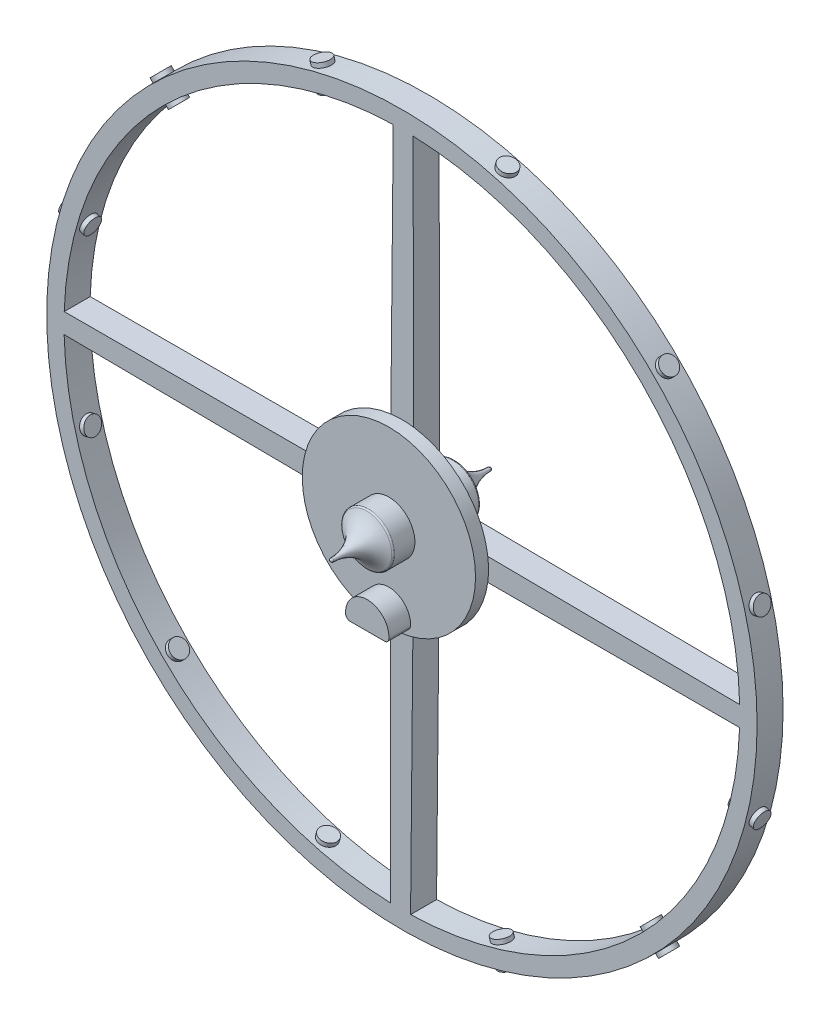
from build123d import *

# Parameters (mm, degrees)
SKETCH1_R            = 41
SKETCH1_R_2          = 3
BOSS_EXTRUDE2_DEPTH  = 3
SWEEP1_PROFILE_R     = 1
CIRPATTERN1_COUNT    = 12
SKETCH63_R           = 10
SKETCH63_R_2         = 3
BOSS_EXTRUDE3_DEPTH  = 1.5
BOSS_EXTRUDE4_DEPTH  = 4
BOSS_EXTRUDE5_START  = 2
SKETCH64_R           = 3
BOSS_EXTRUDE5_DEPTH  = 5
FILLET2_R            = 0.2
FILLET2_OF_MIRROR1_R = 0.2


with BuildPart() as part:
    # Sketch1 → Boss-Extrude2 (new body)
    with BuildSketch(Plane.XY):
        Circle(SKETCH1_R)
        Circle(SKETCH1_R_2, mode=Mode.SUBTRACT)
        with BuildLine():
            Line((38.987177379, 1), (3.771236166, 1.333333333))
            ThreePointArc((3.771236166, 1.333333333), (2.828427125, 2.828427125), (1.333333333, 3.771236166))
            Line((1.333333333, 3.771236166), (1.30155401, 38.978275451))
            ThreePointArc((1.30155401, 38.978275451), (27.683620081, 27.470296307), (38.987177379, 1))
        make_face(mode=Mode.SUBTRACT)
        with BuildLine():
            Line((-1, 38.987177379), (-1.333333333, 3.771236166))
            ThreePointArc((-1.333333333, 3.771236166), (-2.828427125, 2.828427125), (-3.771236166, 1.333333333))
            Line((-3.771236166, 1.333333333), (-38.978275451, 1.30155401))
            ThreePointArc((-38.978275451, 1.30155401), (-27.470296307, 27.683620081), (-1, 38.987177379))
        make_face(mode=Mode.SUBTRACT)
        with BuildLine():
            Line((38.978275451, -1.30155401), (3.771236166, -1.333333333))
            ThreePointArc((3.771236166, -1.333333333), (2.828427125, -2.828427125), (1.333333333, -3.771236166))
            Line((1.333333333, -3.771236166), (1, -38.987177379))
            ThreePointArc((1, -38.987177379), (27.470296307, -27.683620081), (38.978275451, -1.30155401))
        make_face(mode=Mode.SUBTRACT)
        with BuildLine():
            Line((-1.30155401, -38.978275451), (-1.333333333, -3.771236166))
            ThreePointArc((-1.333333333, -3.771236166), (-2.828427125, -2.828427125), (-3.771236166, -1.333333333))
            Line((-3.771236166, -1.333333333), (-38.987177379, -1))
            ThreePointArc((-38.987177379, -1), (-27.683620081, -27.470296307), (-1.30155401, -38.978275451))
        make_face(mode=Mode.SUBTRACT)
    extrude(amount=BOSS_EXTRUDE2_DEPTH)

    # Sweep1: sweep along a path in Sketch2
    with BuildLine(Plane.XY.offset(1.5)) as sweep1_path:
        Line((9.964533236, 37.188144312), (10.740990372, 40.085921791))
    # Sweep1 profile (on start of the path) → Sweep1 (sweep)
    with BuildSketch(Plane(origin=(9.964533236, 37.188144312, 1.5), x_dir=(0.965925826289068, -0.25881904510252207, 0), z_dir=(0.25881904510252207, 0.965925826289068, 0))):
        Circle(SWEEP1_PROFILE_R)
    sweep1 = sweep(path=sweep1_path.line)

    # CirPattern1: Sweep1 ×12 about axis
    cirpattern1_axis = Axis((0, 0, 0), (0, 0, 1))
    for i in range(1, CIRPATTERN1_COUNT):
        add(sweep1.rotate(cirpattern1_axis, i * 360 / CIRPATTERN1_COUNT))

    # Sketch63 → Boss-Extrude3 (add)
    with BuildSketch(Plane.XY.offset(3)):
        with Locations(Location((0, 0, 0), (0, 0, 187.326006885))):
            Circle(SKETCH63_R)
        Circle(SKETCH63_R_2, mode=Mode.SUBTRACT)
        with BuildLine():
            Line((-1.993589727, -9.16), (1.993589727, -9.16))
            ThreePointArc((1.993589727, -9.16), (2.332706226, -9.027423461), (2.491987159, -8.7))
            ThreePointArc((2.491987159, -8.7), (0, -6), (-2.491987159, -8.7))
            ThreePointArc((-2.491987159, -8.7), (-2.332706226, -9.027423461), (-1.993589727, -9.16))
        make_face(mode=Mode.SUBTRACT)
    extrude(amount=BOSS_EXTRUDE3_DEPTH)

    # Sketch63_2 → Boss-Extrude4 (add)
    with BuildSketch(Plane.XY.offset(3)):
        with BuildLine():
            Line((-1.993589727, -9.16), (1.993589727, -9.16))
            ThreePointArc((1.993589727, -9.16), (2.332706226, -9.027423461), (2.491987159, -8.7))
            ThreePointArc((2.491987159, -8.7), (0, -6), (-2.491987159, -8.7))
            ThreePointArc((-2.491987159, -8.7), (-2.332706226, -9.027423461), (-1.993589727, -9.16))
        make_face()
    extrude(amount=BOSS_EXTRUDE4_DEPTH)

    # Sketch64 → Boss-Extrude5 (add, symmetric)
    with BuildSketch(Plane.XY.offset(BOSS_EXTRUDE5_START)):
        Circle(SKETCH64_R)
    extrude(amount=BOSS_EXTRUDE5_DEPTH, both=True)

    # Sketch65 → Revolve2 (revolve)
    with BuildSketch(Plane(origin=(0, 0, 0), x_dir=(0, 0, -1), z_dir=(1, 0, 0)), mode=Mode.PRIVATE) as revolve2_sk:
        with BuildLine():
            ThreePointArc((7.066180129, 0.2), (7.207601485, 0.141421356), (7.266180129, 0))
            Line((7.266180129, 0), (3, 0))
            Line((3, 0), (3, 3))
            ThreePointArc((3, 3), (4.597687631, 0.967705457), (7.066180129, 0.2))
        make_face()
    revolve2 = revolve(revolve2_sk.sketch.rotate(Axis((0, 0, -0.15), (0, 0, 1)), 90), axis=Axis((0, 0, -0.15), (0, 0, 1)))

    # Fillet2
    fillet2_edges = [part.edges().sort_by_distance(p)[0] for p in [
        (0, -3, -3),
    ]]
    fillet(fillet2_edges, radius=FILLET2_R)

    # Mirror1: Revolve2 across plane
    add(revolve2.mirror(Plane(origin=(0, 0, 2), x_dir=(1, 0, 0), z_dir=(0, 0, -1))))

    # Fillet2 of Mirror1
    fillet2_of_mirror1_edges = [part.edges().sort_by_distance(p)[0] for p in [
        (0, -3, 7),
    ]]
    fillet(fillet2_of_mirror1_edges, radius=FILLET2_OF_MIRROR1_R)


solid = part.part
